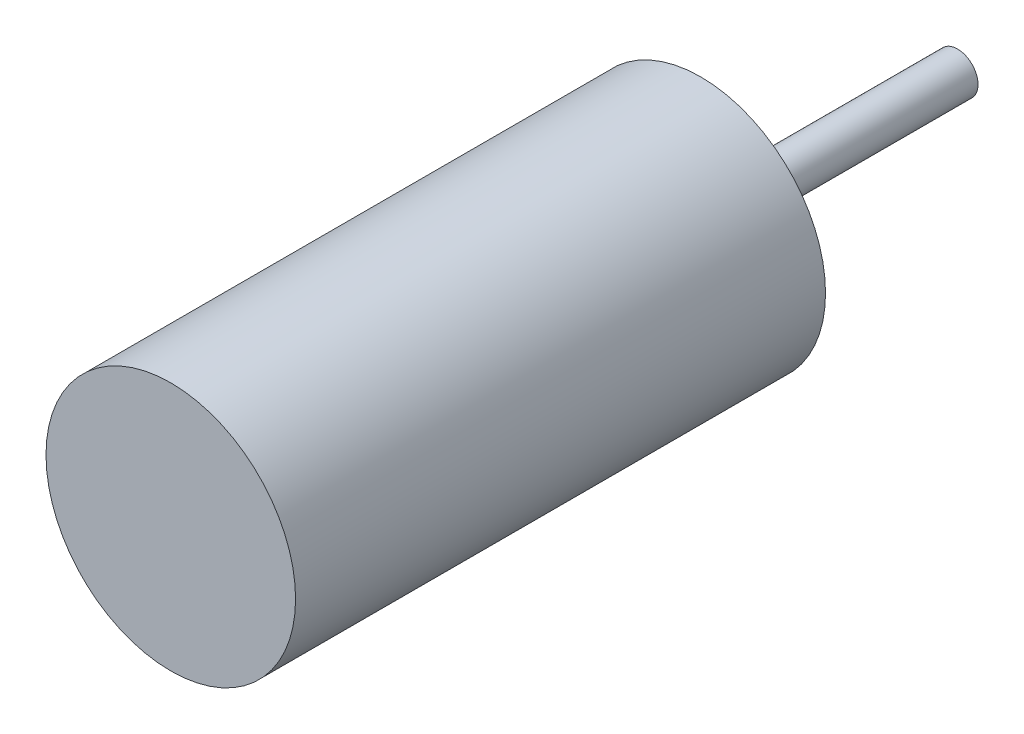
ISO-10303-21;
HEADER;
FILE_DESCRIPTION(('STEP AP214'),'2;1');
FILE_NAME('part.step','',(''),(''),'','','');
FILE_SCHEMA(('AUTOMOTIVE_DESIGN { 1 0 10303 214 1 1 1 1 }'));
ENDSEC;
DATA;
#1=APPLICATION_CONTEXT('core data for automotive mechanical design processes');
#2=APPLICATION_PROTOCOL_DEFINITION('international standard','automotive_design',2000,#1);
#3=PRODUCT_CONTEXT('',#1,'mechanical');
#4=PRODUCT('Part','Part','',(#3));
#5=PRODUCT_RELATED_PRODUCT_CATEGORY('part','',(#4));
#6=PRODUCT_DEFINITION_FORMATION('','',#4);
#7=PRODUCT_DEFINITION_CONTEXT('part definition',#1,'design');
#8=PRODUCT_DEFINITION('design','',#6,#7);
#9=PRODUCT_DEFINITION_SHAPE('','',#8);
#10=(LENGTH_UNIT() NAMED_UNIT(*) SI_UNIT(.MILLI.,.METRE.));
#11=(NAMED_UNIT(*) PLANE_ANGLE_UNIT() SI_UNIT($,.RADIAN.));
#12=(NAMED_UNIT(*) SI_UNIT($,.STERADIAN.) SOLID_ANGLE_UNIT());
#13=UNCERTAINTY_MEASURE_WITH_UNIT(LENGTH_MEASURE(1.E-05),#10,'distance_accuracy_value','');
#14=(GEOMETRIC_REPRESENTATION_CONTEXT(3) GLOBAL_UNCERTAINTY_ASSIGNED_CONTEXT((#13)) GLOBAL_UNIT_ASSIGNED_CONTEXT((#10,
#11,#12)) REPRESENTATION_CONTEXT('',''));
#15=CARTESIAN_POINT('',(0.,0.,0.));
#16=DIRECTION('',(0.,0.,1.));
#17=DIRECTION('',(1.,0.,0.));
#18=AXIS2_PLACEMENT_3D('',#15,#16,#17);
#19=CARTESIAN_POINT('',(0.,0.,51.6));
#20=DIRECTION('',(0.,0.,-1.));
#21=DIRECTION('',(-1.,0.,0.));
#22=AXIS2_PLACEMENT_3D('',#19,#20,#21);
#23=CYLINDRICAL_SURFACE('',#22,12.15);
#24=CARTESIAN_POINT('',(0.,0.,51.6));
#25=DIRECTION('',(0.,0.,1.));
#26=DIRECTION('',(1.,0.,0.));
#27=AXIS2_PLACEMENT_3D('',#24,#25,#26);
#28=CIRCLE('',#27,12.15);
#29=CARTESIAN_POINT('',(-12.15,0.,51.6));
#30=VERTEX_POINT('',#29);
#31=EDGE_CURVE('E51',#30,#30,#28,.T.);
#32=CARTESIAN_POINT('',(0.,0.,0.));
#33=DIRECTION('',(0.,0.,1.));
#34=DIRECTION('',(1.,0.,0.));
#35=AXIS2_PLACEMENT_3D('',#32,#33,#34);
#36=CIRCLE('',#35,12.15);
#37=CARTESIAN_POINT('',(-12.15,0.,0.));
#38=VERTEX_POINT('',#37);
#39=EDGE_CURVE('E40',#38,#38,#36,.T.);
#40=CARTESIAN_POINT('',(-12.15,0.,51.6));
#41=CARTESIAN_POINT('',(-12.15,0.,51.0625));
#42=CARTESIAN_POINT('',(-12.15,0.,50.525));
#43=CARTESIAN_POINT('',(-12.15,0.,49.45));
#44=CARTESIAN_POINT('',(-12.15,0.,48.9125));
#45=CARTESIAN_POINT('',(-12.15,0.,47.8375));
#46=CARTESIAN_POINT('',(-12.15,0.,47.3));
#47=CARTESIAN_POINT('',(-12.15,0.,46.225));
#48=CARTESIAN_POINT('',(-12.15,0.,45.6875));
#49=CARTESIAN_POINT('',(-12.15,0.,44.6125));
#50=CARTESIAN_POINT('',(-12.15,0.,44.075));
#51=CARTESIAN_POINT('',(-12.15,0.,43.));
#52=CARTESIAN_POINT('',(-12.15,0.,42.4625));
#53=CARTESIAN_POINT('',(-12.15,0.,41.3875));
#54=CARTESIAN_POINT('',(-12.15,0.,40.85));
#55=CARTESIAN_POINT('',(-12.15,0.,39.775));
#56=CARTESIAN_POINT('',(-12.15,0.,39.2375));
#57=CARTESIAN_POINT('',(-12.15,0.,38.1625));
#58=CARTESIAN_POINT('',(-12.15,0.,37.625));
#59=CARTESIAN_POINT('',(-12.15,0.,36.55));
#60=CARTESIAN_POINT('',(-12.15,0.,36.0125));
#61=CARTESIAN_POINT('',(-12.15,0.,34.9375));
#62=CARTESIAN_POINT('',(-12.15,0.,34.4));
#63=CARTESIAN_POINT('',(-12.15,0.,33.325));
#64=CARTESIAN_POINT('',(-12.15,0.,32.7875));
#65=CARTESIAN_POINT('',(-12.15,0.,31.7125));
#66=CARTESIAN_POINT('',(-12.15,0.,31.175));
#67=CARTESIAN_POINT('',(-12.15,0.,30.1));
#68=CARTESIAN_POINT('',(-12.15,0.,29.5625));
#69=CARTESIAN_POINT('',(-12.15,0.,28.4875));
#70=CARTESIAN_POINT('',(-12.15,0.,27.95));
#71=CARTESIAN_POINT('',(-12.15,0.,26.875));
#72=CARTESIAN_POINT('',(-12.15,0.,26.3375));
#73=CARTESIAN_POINT('',(-12.15,0.,25.2625));
#74=CARTESIAN_POINT('',(-12.15,0.,24.725));
#75=CARTESIAN_POINT('',(-12.15,0.,23.65));
#76=CARTESIAN_POINT('',(-12.15,0.,23.1125));
#77=CARTESIAN_POINT('',(-12.15,0.,22.0375));
#78=CARTESIAN_POINT('',(-12.15,0.,21.5));
#79=CARTESIAN_POINT('',(-12.15,0.,20.425));
#80=CARTESIAN_POINT('',(-12.15,0.,19.8875));
#81=CARTESIAN_POINT('',(-12.15,0.,18.8125));
#82=CARTESIAN_POINT('',(-12.15,0.,18.275));
#83=CARTESIAN_POINT('',(-12.15,0.,17.2));
#84=CARTESIAN_POINT('',(-12.15,0.,16.6625));
#85=CARTESIAN_POINT('',(-12.15,0.,15.5875));
#86=CARTESIAN_POINT('',(-12.15,0.,15.05));
#87=CARTESIAN_POINT('',(-12.15,0.,13.975));
#88=CARTESIAN_POINT('',(-12.15,0.,13.4375));
#89=CARTESIAN_POINT('',(-12.15,0.,12.3625));
#90=CARTESIAN_POINT('',(-12.15,0.,11.825));
#91=CARTESIAN_POINT('',(-12.15,0.,10.75));
#92=CARTESIAN_POINT('',(-12.15,0.,10.2125));
#93=CARTESIAN_POINT('',(-12.15,0.,9.1375));
#94=CARTESIAN_POINT('',(-12.15,0.,8.6));
#95=CARTESIAN_POINT('',(-12.15,0.,7.525));
#96=CARTESIAN_POINT('',(-12.15,0.,6.9875));
#97=CARTESIAN_POINT('',(-12.15,0.,5.9125));
#98=CARTESIAN_POINT('',(-12.15,0.,5.375));
#99=CARTESIAN_POINT('',(-12.15,0.,4.3));
#100=CARTESIAN_POINT('',(-12.15,0.,3.7625));
#101=CARTESIAN_POINT('',(-12.15,0.,2.6875));
#102=CARTESIAN_POINT('',(-12.15,0.,2.15));
#103=CARTESIAN_POINT('',(-12.15,0.,1.075));
#104=CARTESIAN_POINT('',(-12.15,0.,0.537500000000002));
#105=CARTESIAN_POINT('',(-12.15,0.,0.));
#106=B_SPLINE_CURVE_WITH_KNOTS('',3,(#40,#41,#42,#43,#44,#45,#46,#47,#48,#49,#50,#51,#52,#53,
#54,#55,#56,#57,#58,#59,#60,#61,#62,#63,#64,#65,#66,#67,#68,#69,#70,#71,#72,#73,#74,#75,#76,#77,
#78,#79,#80,#81,#82,#83,#84,#85,#86,#87,#88,#89,#90,#91,#92,#93,#94,#95,#96,#97,#98,#99,#100,
#101,#102,#103,#104,#105),.UNSPECIFIED.,.F.,.F.,(4,2,2,2,2,2,2,2,2,2,2,2,2,2,2,2,2,2,2,2,2,2,2,
2,2,2,2,2,2,2,2,2,4),(0.,1.6125,3.225,4.8375,6.45,8.06249999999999,9.675,11.2875,12.9,14.5125,
16.125,17.7375,19.35,20.9625,22.575,24.1875,25.8,27.4125,29.025,30.6375,32.25,33.8625,35.475,
37.0875,38.7,40.3125,41.925,43.5375,45.15,46.7625,48.375,49.9875,51.6),.UNSPECIFIED.);
#107=EDGE_CURVE('BSEAM37',#30,#38,#106,.T.);
#108=ORIENTED_EDGE('',*,*,#31,.F.);
#109=ORIENTED_EDGE('',*,*,#39,.T.);
#110=ORIENTED_EDGE('',*,*,#107,.T.);
#111=ORIENTED_EDGE('',*,*,#107,.F.);
#112=EDGE_LOOP('',(#108,#110,#109,#111));
#113=FACE_BOUND('',#112,.T.);
#114=ADVANCED_FACE('F37',(#113),#23,.T.);
#115=CARTESIAN_POINT('',(0.,0.,51.6));
#116=DIRECTION('',(0.,0.,1.));
#117=DIRECTION('',(1.,0.,0.));
#118=AXIS2_PLACEMENT_3D('',#115,#116,#117);
#119=PLANE('',#118);
#120=ORIENTED_EDGE('',*,*,#31,.T.);
#121=EDGE_LOOP('',(#120));
#122=FACE_BOUND('',#121,.T.);
#123=ADVANCED_FACE('F71',(#122),#119,.T.);
#124=CARTESIAN_POINT('',(0.,0.,0.));
#125=DIRECTION('',(0.,0.,1.));
#126=DIRECTION('',(1.,0.,0.));
#127=AXIS2_PLACEMENT_3D('',#124,#125,#126);
#128=PLANE('',#127);
#129=CARTESIAN_POINT('',(0.,0.,0.));
#130=DIRECTION('',(0.,0.,-1.));
#131=DIRECTION('',(-1.,0.,0.));
#132=AXIS2_PLACEMENT_3D('',#129,#130,#131);
#133=CIRCLE('',#132,3.5);
#134=CARTESIAN_POINT('',(-3.5,0.,0.));
#135=VERTEX_POINT('',#134);
#136=EDGE_CURVE('E45',#135,#135,#133,.T.);
#137=ORIENTED_EDGE('',*,*,#136,.F.);
#138=EDGE_LOOP('',(#137));
#139=FACE_BOUND('',#138,.T.);
#140=ORIENTED_EDGE('',*,*,#39,.F.);
#141=EDGE_LOOP('',(#140));
#142=FACE_BOUND('',#141,.T.);
#143=ADVANCED_FACE('F68',(#139,#142),#128,.F.);
#144=CARTESIAN_POINT('',(0.,0.,-2.4));
#145=DIRECTION('',(0.,0.,1.));
#146=DIRECTION('',(1.,0.,0.));
#147=AXIS2_PLACEMENT_3D('',#144,#145,#146);
#148=CYLINDRICAL_SURFACE('',#147,3.5);
#149=CARTESIAN_POINT('',(0.,0.,-2.4));
#150=DIRECTION('',(0.,0.,-1.));
#151=DIRECTION('',(-1.,0.,0.));
#152=AXIS2_PLACEMENT_3D('',#149,#150,#151);
#153=CIRCLE('',#152,3.5);
#154=CARTESIAN_POINT('',(-3.5,0.,-2.4));
#155=VERTEX_POINT('',#154);
#156=EDGE_CURVE('E56',#155,#155,#153,.T.);
#157=ORIENTED_EDGE('',*,*,#156,.F.);
#158=EDGE_LOOP('',(#157));
#159=FACE_BOUND('',#158,.T.);
#160=ORIENTED_EDGE('',*,*,#136,.T.);
#161=EDGE_LOOP('',(#160));
#162=FACE_BOUND('',#161,.T.);
#163=ADVANCED_FACE('F70',(#159,#162),#148,.T.);
#164=CARTESIAN_POINT('',(0.,0.,-2.4));
#165=DIRECTION('',(0.,0.,-1.));
#166=DIRECTION('',(-1.,0.,0.));
#167=AXIS2_PLACEMENT_3D('',#164,#165,#166);
#168=PLANE('',#167);
#169=CARTESIAN_POINT('',(0.,0.,-2.4));
#170=DIRECTION('',(0.,0.,-1.));
#171=DIRECTION('',(-1.,0.,0.));
#172=AXIS2_PLACEMENT_3D('',#169,#170,#171);
#173=CIRCLE('',#172,2.);
#174=CARTESIAN_POINT('',(-2.,0.,-2.4));
#175=VERTEX_POINT('',#174);
#176=EDGE_CURVE('E10',#175,#175,#173,.T.);
#177=ORIENTED_EDGE('',*,*,#176,.F.);
#178=EDGE_LOOP('',(#177));
#179=FACE_BOUND('',#178,.T.);
#180=ORIENTED_EDGE('',*,*,#156,.T.);
#181=EDGE_LOOP('',(#180));
#182=FACE_BOUND('',#181,.T.);
#183=ADVANCED_FACE('F77',(#179,#182),#168,.T.);
#184=CARTESIAN_POINT('',(0.,0.,-25.));
#185=DIRECTION('',(0.,0.,1.));
#186=DIRECTION('',(1.,0.,0.));
#187=AXIS2_PLACEMENT_3D('',#184,#185,#186);
#188=CYLINDRICAL_SURFACE('',#187,2.);
#189=CARTESIAN_POINT('',(0.,0.,-25.));
#190=DIRECTION('',(0.,0.,-1.));
#191=DIRECTION('',(-1.,0.,0.));
#192=AXIS2_PLACEMENT_3D('',#189,#190,#191);
#193=CIRCLE('',#192,2.);
#194=CARTESIAN_POINT('',(-2.,0.,-25.));
#195=VERTEX_POINT('',#194);
#196=EDGE_CURVE('E55',#195,#195,#193,.T.);
#197=ORIENTED_EDGE('',*,*,#196,.F.);
#198=EDGE_LOOP('',(#197));
#199=FACE_BOUND('',#198,.T.);
#200=ORIENTED_EDGE('',*,*,#176,.T.);
#201=EDGE_LOOP('',(#200));
#202=FACE_BOUND('',#201,.T.);
#203=ADVANCED_FACE('F109',(#199,#202),#188,.T.);
#204=CARTESIAN_POINT('',(0.,0.,-25.));
#205=DIRECTION('',(0.,0.,-1.));
#206=DIRECTION('',(-1.,0.,0.));
#207=AXIS2_PLACEMENT_3D('',#204,#205,#206);
#208=PLANE('',#207);
#209=ORIENTED_EDGE('',*,*,#196,.T.);
#210=EDGE_LOOP('',(#209));
#211=FACE_BOUND('',#210,.T.);
#212=ADVANCED_FACE('F119',(#211),#208,.T.);
#213=CLOSED_SHELL('',(#114,#123,#143,#163,#183,#203,#212));
#214=MANIFOLD_SOLID_BREP('B2',#213);
#215=ADVANCED_BREP_SHAPE_REPRESENTATION('',(#18,#214),#14);
#216=SHAPE_DEFINITION_REPRESENTATION(#9,#215);
ENDSEC;
END-ISO-10303-21;
